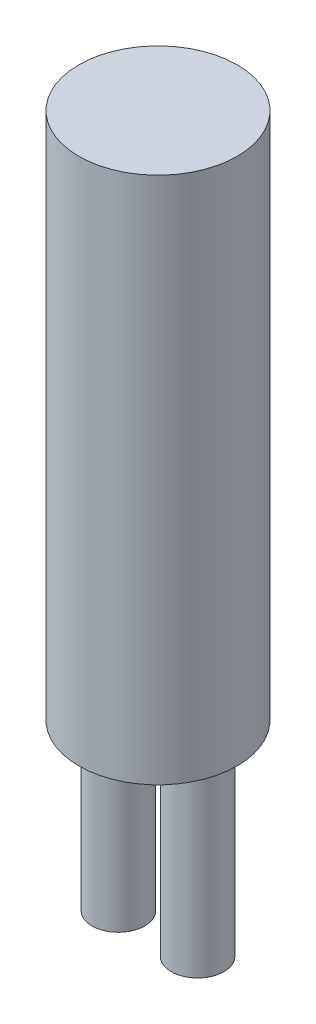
ISO-10303-21;
HEADER;
FILE_DESCRIPTION(('STEP AP214'),'2;1');
FILE_NAME('part.step','',(''),(''),'','','');
FILE_SCHEMA(('AUTOMOTIVE_DESIGN { 1 0 10303 214 1 1 1 1 }'));
ENDSEC;
DATA;
#1=APPLICATION_CONTEXT('core data for automotive mechanical design processes');
#2=APPLICATION_PROTOCOL_DEFINITION('international standard','automotive_design',2000,#1);
#3=PRODUCT_CONTEXT('',#1,'mechanical');
#4=PRODUCT('Part','Part','',(#3));
#5=PRODUCT_RELATED_PRODUCT_CATEGORY('part','',(#4));
#6=PRODUCT_DEFINITION_FORMATION('','',#4);
#7=PRODUCT_DEFINITION_CONTEXT('part definition',#1,'design');
#8=PRODUCT_DEFINITION('design','',#6,#7);
#9=PRODUCT_DEFINITION_SHAPE('','',#8);
#10=(LENGTH_UNIT() NAMED_UNIT(*) SI_UNIT(.MILLI.,.METRE.));
#11=(NAMED_UNIT(*) PLANE_ANGLE_UNIT() SI_UNIT($,.RADIAN.));
#12=(NAMED_UNIT(*) SI_UNIT($,.STERADIAN.) SOLID_ANGLE_UNIT());
#13=UNCERTAINTY_MEASURE_WITH_UNIT(LENGTH_MEASURE(1.E-05),#10,'distance_accuracy_value','');
#14=(GEOMETRIC_REPRESENTATION_CONTEXT(3) GLOBAL_UNCERTAINTY_ASSIGNED_CONTEXT((#13)) GLOBAL_UNIT_ASSIGNED_CONTEXT((#10,
#11,#12)) REPRESENTATION_CONTEXT('',''));
#15=CARTESIAN_POINT('',(0.,0.,0.));
#16=DIRECTION('',(0.,0.,1.));
#17=DIRECTION('',(1.,0.,0.));
#18=AXIS2_PLACEMENT_3D('',#15,#16,#17);
#19=CARTESIAN_POINT('',(6.00001761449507,-7.75923464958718,-7.84999999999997));
#20=DIRECTION('',(0.,-1.,0.));
#21=DIRECTION('',(1.,0.,0.));
#22=AXIS2_PLACEMENT_3D('',#19,#20,#21);
#23=PLANE('',#22);
#24=CARTESIAN_POINT('',(5.25001761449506,-7.75923464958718,-7.84999999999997));
#25=DIRECTION('',(0.,-1.,0.));
#26=DIRECTION('',(1.,0.,0.));
#27=AXIS2_PLACEMENT_3D('',#24,#25,#26);
#28=CIRCLE('',#27,0.5);
#29=CARTESIAN_POINT('',(5.75001761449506,-7.75923464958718,-7.84999999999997));
#30=VERTEX_POINT('',#29);
#31=EDGE_CURVE('E18',#30,#30,#28,.F.);
#32=ORIENTED_EDGE('',*,*,#31,.F.);
#33=EDGE_LOOP('',(#32));
#34=FACE_BOUND('',#33,.T.);
#35=ADVANCED_FACE('F15',(#34),#23,.T.);
#36=CARTESIAN_POINT('',(6.00001761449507,-7.75923464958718,-7.84999999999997));
#37=DIRECTION('',(0.,-1.,0.));
#38=DIRECTION('',(1.,0.,0.));
#39=AXIS2_PLACEMENT_3D('',#36,#37,#38);
#40=PLANE('',#39);
#41=CARTESIAN_POINT('',(6.75001761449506,-7.75923464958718,-7.84999999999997));
#42=DIRECTION('',(0.,-1.,0.));
#43=DIRECTION('',(1.,0.,0.));
#44=AXIS2_PLACEMENT_3D('',#41,#42,#43);
#45=CIRCLE('',#44,0.5);
#46=CARTESIAN_POINT('',(7.25001761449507,-7.75923464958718,-7.84999999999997));
#47=VERTEX_POINT('',#46);
#48=EDGE_CURVE('E34',#47,#47,#45,.F.);
#49=ORIENTED_EDGE('',*,*,#48,.F.);
#50=EDGE_LOOP('',(#49));
#51=FACE_BOUND('',#50,.T.);
#52=ADVANCED_FACE('F44',(#51),#40,.T.);
#53=CARTESIAN_POINT('',(5.25001761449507,-4.25923464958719,-7.84999999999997));
#54=DIRECTION('',(0.,-1.,0.));
#55=DIRECTION('',(1.,0.,0.));
#56=AXIS2_PLACEMENT_3D('',#53,#54,#55);
#57=CYLINDRICAL_SURFACE('',#56,0.5);
#58=CARTESIAN_POINT('',(5.25001761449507,-4.25923464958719,-7.84999999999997));
#59=DIRECTION('',(0.,-1.,0.));
#60=DIRECTION('',(1.,0.,0.));
#61=AXIS2_PLACEMENT_3D('',#58,#59,#60);
#62=CIRCLE('',#61,0.5);
#63=CARTESIAN_POINT('',(5.75001761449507,-4.25923464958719,-7.84999999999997));
#64=VERTEX_POINT('',#63);
#65=EDGE_CURVE('E32',#64,#64,#62,.T.);
#66=ORIENTED_EDGE('',*,*,#65,.T.);
#67=EDGE_LOOP('',(#66));
#68=FACE_BOUND('',#67,.T.);
#69=ORIENTED_EDGE('',*,*,#31,.T.);
#70=EDGE_LOOP('',(#69));
#71=FACE_BOUND('',#70,.T.);
#72=ADVANCED_FACE('F41',(#68,#71),#57,.T.);
#73=CARTESIAN_POINT('',(6.75001761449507,-4.25923464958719,-7.84999999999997));
#74=DIRECTION('',(0.,-1.,0.));
#75=DIRECTION('',(1.,0.,0.));
#76=AXIS2_PLACEMENT_3D('',#73,#74,#75);
#77=CYLINDRICAL_SURFACE('',#76,0.5);
#78=CARTESIAN_POINT('',(6.75001761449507,-4.25923464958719,-7.84999999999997));
#79=DIRECTION('',(0.,-1.,0.));
#80=DIRECTION('',(1.,0.,0.));
#81=AXIS2_PLACEMENT_3D('',#78,#79,#80);
#82=CIRCLE('',#81,0.5);
#83=CARTESIAN_POINT('',(7.25001761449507,-4.25923464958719,-7.84999999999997));
#84=VERTEX_POINT('',#83);
#85=EDGE_CURVE('E27',#84,#84,#82,.T.);
#86=ORIENTED_EDGE('',*,*,#85,.T.);
#87=EDGE_LOOP('',(#86));
#88=FACE_BOUND('',#87,.T.);
#89=ORIENTED_EDGE('',*,*,#48,.T.);
#90=EDGE_LOOP('',(#89));
#91=FACE_BOUND('',#90,.T.);
#92=ADVANCED_FACE('F64',(#88,#91),#77,.T.);
#93=CARTESIAN_POINT('',(6.00001761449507,-4.25923464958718,-7.84999999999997));
#94=DIRECTION('',(0.,1.,0.));
#95=DIRECTION('',(-1.,0.,0.));
#96=AXIS2_PLACEMENT_3D('',#93,#94,#95);
#97=PLANE('',#96);
#98=ORIENTED_EDGE('',*,*,#85,.F.);
#99=EDGE_LOOP('',(#98));
#100=FACE_BOUND('',#99,.T.);
#101=ORIENTED_EDGE('',*,*,#65,.F.);
#102=EDGE_LOOP('',(#101));
#103=FACE_BOUND('',#102,.T.);
#104=CARTESIAN_POINT('',(6.00001761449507,-4.25923464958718,-7.84999999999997));
#105=DIRECTION('',(0.,-1.,0.));
#106=DIRECTION('',(1.,0.,0.));
#107=AXIS2_PLACEMENT_3D('',#104,#105,#106);
#108=CIRCLE('',#107,1.5);
#109=CARTESIAN_POINT('',(7.50001761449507,-4.25923464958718,-7.84999999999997));
#110=VERTEX_POINT('',#109);
#111=EDGE_CURVE('E22',#110,#110,#108,.F.);
#112=ORIENTED_EDGE('',*,*,#111,.F.);
#113=EDGE_LOOP('',(#112));
#114=FACE_BOUND('',#113,.T.);
#115=ADVANCED_FACE('F57',(#100,#103,#114),#97,.F.);
#116=CARTESIAN_POINT('',(6.00001761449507,5.74076535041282,-7.84999999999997));
#117=DIRECTION('',(0.,1.,0.));
#118=DIRECTION('',(-1.,0.,0.));
#119=AXIS2_PLACEMENT_3D('',#116,#117,#118);
#120=PLANE('',#119);
#121=CARTESIAN_POINT('',(6.00001761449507,5.74076535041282,-7.84999999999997));
#122=DIRECTION('',(0.,-1.,0.));
#123=DIRECTION('',(1.,0.,0.));
#124=AXIS2_PLACEMENT_3D('',#121,#122,#123);
#125=CIRCLE('',#124,1.5);
#126=CARTESIAN_POINT('',(7.50001761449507,5.74076535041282,-7.84999999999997));
#127=VERTEX_POINT('',#126);
#128=EDGE_CURVE('E10',#127,#127,#125,.T.);
#129=ORIENTED_EDGE('',*,*,#128,.F.);
#130=EDGE_LOOP('',(#129));
#131=FACE_BOUND('',#130,.T.);
#132=ADVANCED_FACE('F52',(#131),#120,.T.);
#133=CARTESIAN_POINT('',(6.00001761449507,5.74076535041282,-7.84999999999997));
#134=DIRECTION('',(0.,-1.,0.));
#135=DIRECTION('',(1.,0.,0.));
#136=AXIS2_PLACEMENT_3D('',#133,#134,#135);
#137=CYLINDRICAL_SURFACE('',#136,1.5);
#138=ORIENTED_EDGE('',*,*,#128,.T.);
#139=EDGE_LOOP('',(#138));
#140=FACE_BOUND('',#139,.T.);
#141=ORIENTED_EDGE('',*,*,#111,.T.);
#142=EDGE_LOOP('',(#141));
#143=FACE_BOUND('',#142,.T.);
#144=ADVANCED_FACE('F50',(#140,#143),#137,.T.);
#145=CLOSED_SHELL('',(#35,#52,#72,#92,#115,#132,#144));
#146=MANIFOLD_SOLID_BREP('B1',#145);
#147=ADVANCED_BREP_SHAPE_REPRESENTATION('',(#18,#146),#14);
#148=SHAPE_DEFINITION_REPRESENTATION(#9,#147);
ENDSEC;
END-ISO-10303-21;
